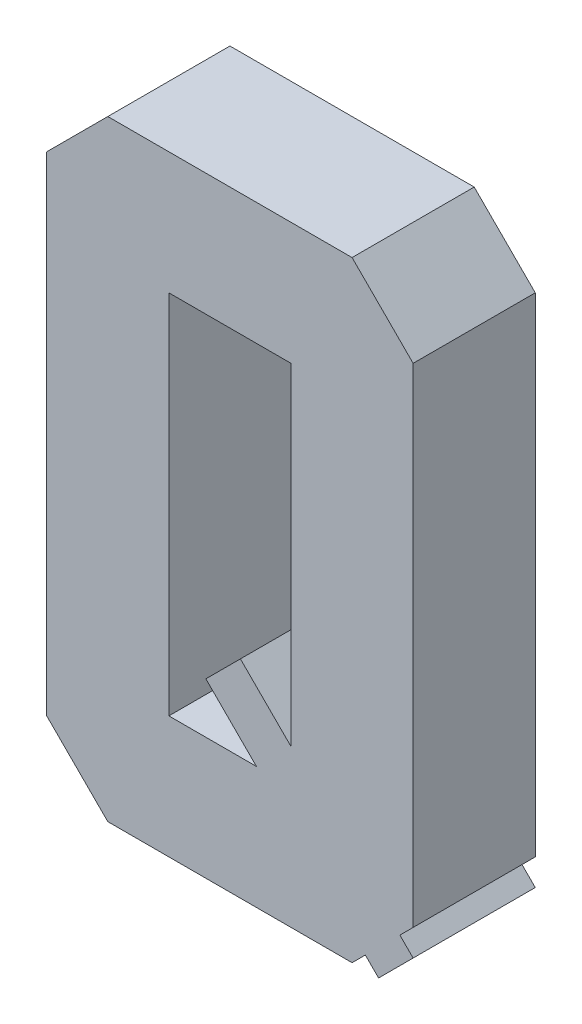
from build123d import *

# Parameters (mm, degrees)
ESQUISSE1_W        = 30
ESQUISSE1_H        = 50
ESQUISSE1_W_2      = 10
ESQUISSE1_H_2      = 30
BOSS_EXTRU_1_DEPTH = 10
CHANFREIN1_SIZE    = 5
BOSS_EXTRU_2_DEPTH = 10


with BuildPart() as part:
    # Esquisse1 → Boss.-Extru.1 (new body)
    with BuildSketch(Plane.XY):
        with Locations((15, 25)):
            Rectangle(ESQUISSE1_W, ESQUISSE1_H)
        with Locations((15, 25)):
            Rectangle(ESQUISSE1_W_2, ESQUISSE1_H_2, mode=Mode.SUBTRACT)
    extrude(amount=BOSS_EXTRU_1_DEPTH)

    # Chanfrein1
    chanfrein1_edges = [part.edges().sort_by_distance(p)[0] for p in [
        (0, 50, 5),
        (30, 50, 5),
        (30, 0, 5),
        (0, 0, 5),
    ]]
    chamfer(chanfrein1_edges, length=CHANFREIN1_SIZE)

    # Esquisse2 → Boss.-Extru.2 (add)
    with BuildSketch(Plane.XY.offset(10)):
        Polygon((27.171572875, 0), (30, 2.828427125), (15.857864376, 16.970562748), (13.029437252, 14.142135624), align=None)
    extrude(amount=-BOSS_EXTRU_2_DEPTH)


solid = part.part
